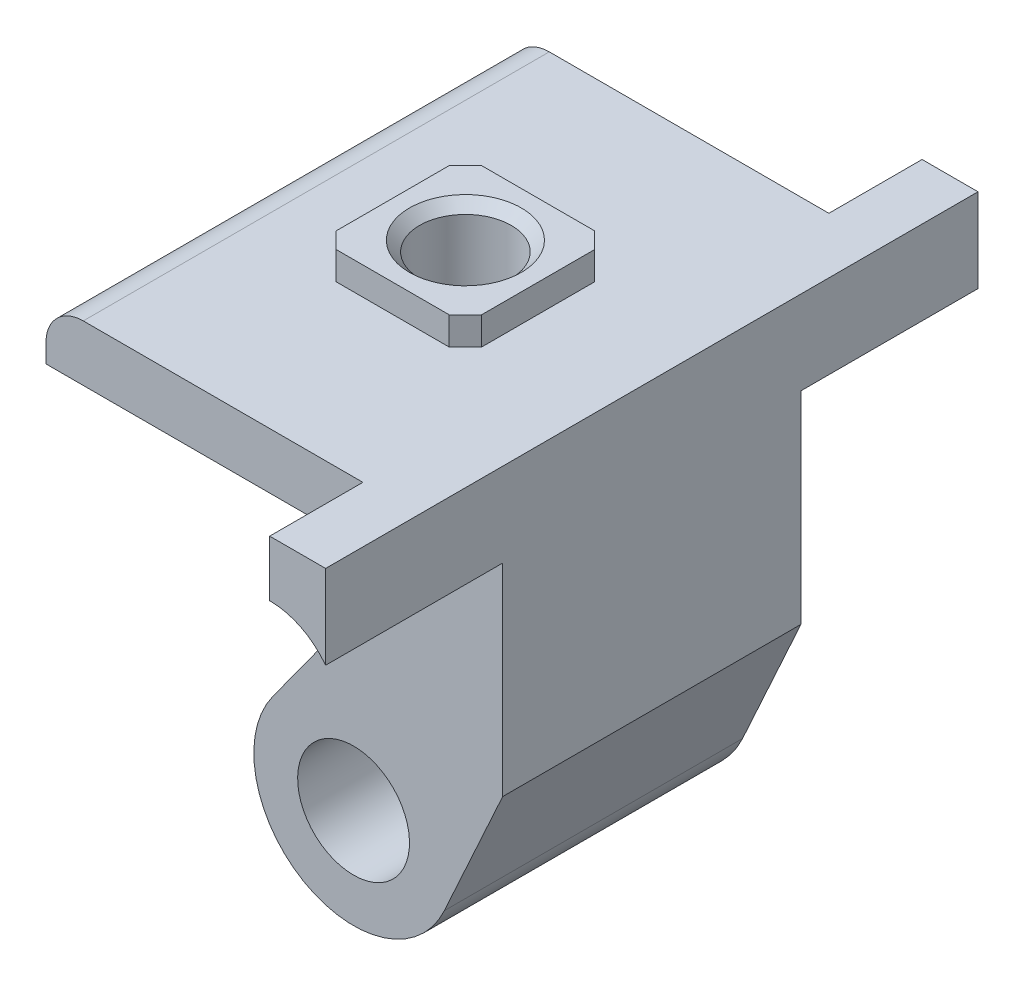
ISO-10303-21;
HEADER;
FILE_DESCRIPTION(('STEP AP214'),'2;1');
FILE_NAME('part.step','',(''),(''),'','','');
FILE_SCHEMA(('AUTOMOTIVE_DESIGN { 1 0 10303 214 1 1 1 1 }'));
ENDSEC;
DATA;
#1=APPLICATION_CONTEXT('core data for automotive mechanical design processes');
#2=APPLICATION_PROTOCOL_DEFINITION('international standard','automotive_design',2000,#1);
#3=PRODUCT_CONTEXT('',#1,'mechanical');
#4=PRODUCT('Part','Part','',(#3));
#5=PRODUCT_RELATED_PRODUCT_CATEGORY('part','',(#4));
#6=PRODUCT_DEFINITION_FORMATION('','',#4);
#7=PRODUCT_DEFINITION_CONTEXT('part definition',#1,'design');
#8=PRODUCT_DEFINITION('design','',#6,#7);
#9=PRODUCT_DEFINITION_SHAPE('','',#8);
#10=(LENGTH_UNIT() NAMED_UNIT(*) SI_UNIT(.MILLI.,.METRE.));
#11=(NAMED_UNIT(*) PLANE_ANGLE_UNIT() SI_UNIT($,.RADIAN.));
#12=(NAMED_UNIT(*) SI_UNIT($,.STERADIAN.) SOLID_ANGLE_UNIT());
#13=UNCERTAINTY_MEASURE_WITH_UNIT(LENGTH_MEASURE(1.E-05),#10,'distance_accuracy_value','');
#14=(GEOMETRIC_REPRESENTATION_CONTEXT(3) GLOBAL_UNCERTAINTY_ASSIGNED_CONTEXT((#13)) GLOBAL_UNIT_ASSIGNED_CONTEXT((#10,
#11,#12)) REPRESENTATION_CONTEXT('',''));
#15=CARTESIAN_POINT('',(0.,0.,0.));
#16=DIRECTION('',(0.,0.,1.));
#17=DIRECTION('',(1.,0.,0.));
#18=AXIS2_PLACEMENT_3D('',#15,#16,#17);
#19=CARTESIAN_POINT('',(1.5,-6.,0.));
#20=DIRECTION('',(0.,-1.,0.));
#21=DIRECTION('',(0.,0.,-1.));
#22=AXIS2_PLACEMENT_3D('',#19,#20,#21);
#23=PLANE('',#22);
#24=CARTESIAN_POINT('',(0.,-6.00000000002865,0.));
#25=DIRECTION('',(0.,-1.,0.));
#26=DIRECTION('',(0.,0.,-1.));
#27=AXIS2_PLACEMENT_3D('',#24,#25,#26);
#28=CIRCLE('',#27,3.00000000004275);
#29=CARTESIAN_POINT('',(2.02711197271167,-6.00000000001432,2.21151917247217));
#30=VERTEX_POINT('',#29);
#31=CARTESIAN_POINT('',(2.02711197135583,-6.00000000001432,-2.21151917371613));
#32=VERTEX_POINT('',#31);
#33=EDGE_CURVE('E19',#30,#32,#28,.F.);
#34=ORIENTED_EDGE('',*,*,#33,.T.);
#35=DIRECTION('',(0.,0.,1.));
#36=VECTOR('',#35,1.);
#37=CARTESIAN_POINT('',(2.02711197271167,-6.,-8.));
#38=LINE('',#37,#36);
#39=EDGE_CURVE('E137',#32,#30,#38,.T.);
#40=ORIENTED_EDGE('',*,*,#39,.T.);
#41=EDGE_LOOP('',(#34,#40));
#42=FACE_BOUND('',#41,.T.);
#43=ADVANCED_FACE('F16',(#42),#23,.F.);
#44=CARTESIAN_POINT('',(0.,-3.,0.));
#45=DIRECTION('',(0.,1.,0.));
#46=DIRECTION('',(0.,0.,1.));
#47=AXIS2_PLACEMENT_3D('',#44,#45,#46);
#48=CYLINDRICAL_SURFACE('',#47,2.459);
#49=CARTESIAN_POINT('',(0.,-5.45899999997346,0.));
#50=DIRECTION('',(0.,-1.,0.));
#51=DIRECTION('',(-1.,0.,0.));
#52=AXIS2_PLACEMENT_3D('',#49,#50,#51);
#53=CIRCLE('',#52,2.45899999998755);
#54=CARTESIAN_POINT('',(-2.45899999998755,-5.45899999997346,0.));
#55=VERTEX_POINT('',#54);
#56=EDGE_CURVE('E142',#55,#55,#53,.T.);
#57=ORIENTED_EDGE('',*,*,#56,.T.);
#58=EDGE_LOOP('',(#57));
#59=FACE_BOUND('',#58,.T.);
#60=CARTESIAN_POINT('',(0.,-0.540999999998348,0.));
#61=DIRECTION('',(0.,1.,0.));
#62=DIRECTION('',(-1.,0.,0.));
#63=AXIS2_PLACEMENT_3D('',#60,#61,#62);
#64=CIRCLE('',#63,2.45899999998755);
#65=CARTESIAN_POINT('',(-2.45899999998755,-0.540999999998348,0.));
#66=VERTEX_POINT('',#65);
#67=EDGE_CURVE('E150',#66,#66,#64,.T.);
#68=ORIENTED_EDGE('',*,*,#67,.T.);
#69=EDGE_LOOP('',(#68));
#70=FACE_BOUND('',#69,.T.);
#71=ADVANCED_FACE('F732',(#59,#70),#48,.F.);
#72=CARTESIAN_POINT('',(0.,-6.00000000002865,0.));
#73=DIRECTION('',(0.,-1.,0.));
#74=DIRECTION('',(0.,0.,-1.));
#75=AXIS2_PLACEMENT_3D('',#72,#73,#74);
#76=CONICAL_SURFACE('',#75,3.00000000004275,0.785398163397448);
#77=ORIENTED_EDGE('',*,*,#56,.F.);
#78=EDGE_LOOP('',(#77));
#79=FACE_BOUND('',#78,.T.);
#80=CARTESIAN_POINT('',(0.,-6.00000000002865,0.));
#81=DIRECTION('',(0.,-1.,0.));
#82=DIRECTION('',(0.,0.,-1.));
#83=AXIS2_PLACEMENT_3D('',#80,#81,#82);
#84=CIRCLE('',#83,3.00000000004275);
#85=EDGE_CURVE('E144',#32,#30,#84,.F.);
#86=ORIENTED_EDGE('',*,*,#85,.F.);
#87=ORIENTED_EDGE('',*,*,#33,.F.);
#88=EDGE_LOOP('',(#86,#87));
#89=FACE_BOUND('',#88,.T.);
#90=ADVANCED_FACE('F145',(#79,#89),#76,.F.);
#91=CARTESIAN_POINT('',(2.02711197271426,-6.99999999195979,-8.));
#92=DIRECTION('',(0.,0.,1.));
#93=DIRECTION('',(1.,0.,0.));
#94=AXIS2_PLACEMENT_3D('',#91,#92,#93);
#95=CYLINDRICAL_SURFACE('',#94,0.99999999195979);
#96=DIRECTION('',(0.,0.,-1.));
#97=VECTOR('',#96,1.);
#98=CARTESIAN_POINT('',(2.02711197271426,-6.,-8.));
#99=LINE('',#98,#97);
#100=CARTESIAN_POINT('',(2.02711197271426,-6.,8.));
#101=VERTEX_POINT('',#100);
#102=EDGE_CURVE('E149',#30,#101,#99,.F.);
#103=ORIENTED_EDGE('',*,*,#102,.F.);
#104=ORIENTED_EDGE('',*,*,#39,.F.);
#105=DIRECTION('',(0.,0.,-1.));
#106=VECTOR('',#105,1.);
#107=CARTESIAN_POINT('',(2.02711197,-6.,-8.));
#108=LINE('',#107,#106);
#109=CARTESIAN_POINT('',(2.02711197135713,-6.,-8.));
#110=VERTEX_POINT('',#109);
#111=EDGE_CURVE('E155',#110,#32,#108,.F.);
#112=ORIENTED_EDGE('',*,*,#111,.F.);
#113=CARTESIAN_POINT('',(2.02711197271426,-6.99999999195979,-8.));
#114=DIRECTION('',(0.,0.,1.));
#115=DIRECTION('',(1.,0.,0.));
#116=AXIS2_PLACEMENT_3D('',#113,#114,#115);
#117=CIRCLE('',#116,0.99999999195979);
#118=CARTESIAN_POINT('',(2.99128057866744,-6.73470980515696,-8.));
#119=VERTEX_POINT('',#118);
#120=EDGE_CURVE('E158',#119,#110,#117,.T.);
#121=ORIENTED_EDGE('',*,*,#120,.F.);
#122=DIRECTION('',(0.,0.,1.));
#123=VECTOR('',#122,1.);
#124=CARTESIAN_POINT('',(2.99128058,-6.73470981,-8.));
#125=LINE('',#124,#123);
#126=CARTESIAN_POINT('',(2.99128057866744,-6.73470980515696,8.));
#127=VERTEX_POINT('',#126);
#128=EDGE_CURVE('E164',#127,#119,#125,.F.);
#129=ORIENTED_EDGE('',*,*,#128,.F.);
#130=CARTESIAN_POINT('',(2.02711197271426,-6.99999999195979,8.));
#131=DIRECTION('',(0.,0.,1.));
#132=DIRECTION('',(1.,0.,0.));
#133=AXIS2_PLACEMENT_3D('',#130,#131,#132);
#134=CIRCLE('',#133,0.99999999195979);
#135=EDGE_CURVE('E157',#101,#127,#134,.F.);
#136=ORIENTED_EDGE('',*,*,#135,.F.);
#137=EDGE_LOOP('',(#103,#104,#112,#121,#129,#136));
#138=FACE_BOUND('',#137,.T.);
#139=ADVANCED_FACE('F154',(#138),#95,.F.);
#140=CARTESIAN_POINT('',(1.66134159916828,-9.44010398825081,-8.));
#141=DIRECTION('',(0.,0.,1.));
#142=DIRECTION('',(1.,0.,0.));
#143=AXIS2_PLACEMENT_3D('',#140,#141,#142);
#144=CYLINDRICAL_SURFACE('',#143,1.99999996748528);
#145=CARTESIAN_POINT('',(1.66134159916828,-9.44010398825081,-8.));
#146=DIRECTION('',(0.,0.,1.));
#147=DIRECTION('',(1.,0.,0.));
#148=AXIS2_PLACEMENT_3D('',#145,#146,#147);
#149=CIRCLE('',#148,1.99999996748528);
#150=CARTESIAN_POINT('',(3.28092430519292,-10.6135398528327,-8.));
#151=VERTEX_POINT('',#150);
#152=CARTESIAN_POINT('',(3.58967879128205,-8.90952360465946,-8.));
#153=VERTEX_POINT('',#152);
#154=EDGE_CURVE('E184',#151,#153,#149,.T.);
#155=ORIENTED_EDGE('',*,*,#154,.F.);
#156=DIRECTION('',(0.,0.,1.));
#157=VECTOR('',#156,1.);
#158=CARTESIAN_POINT('',(3.2809243,-10.61353986,-8.));
#159=LINE('',#158,#157);
#160=CARTESIAN_POINT('',(3.28092430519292,-10.6135398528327,8.));
#161=VERTEX_POINT('',#160);
#162=EDGE_CURVE('E295',#161,#151,#159,.F.);
#163=ORIENTED_EDGE('',*,*,#162,.F.);
#164=CARTESIAN_POINT('',(1.66134159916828,-9.44010398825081,8.));
#165=DIRECTION('',(0.,0.,1.));
#166=DIRECTION('',(1.,0.,0.));
#167=AXIS2_PLACEMENT_3D('',#164,#165,#166);
#168=CIRCLE('',#167,1.99999996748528);
#169=CARTESIAN_POINT('',(3.58967879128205,-8.90952360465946,8.));
#170=VERTEX_POINT('',#169);
#171=EDGE_CURVE('E239',#170,#161,#168,.F.);
#172=ORIENTED_EDGE('',*,*,#171,.F.);
#173=DIRECTION('',(0.,0.,1.));
#174=VECTOR('',#173,1.);
#175=CARTESIAN_POINT('',(3.58967879,-8.9095236,-8.));
#176=LINE('',#175,#174);
#177=EDGE_CURVE('E168',#153,#170,#176,.T.);
#178=ORIENTED_EDGE('',*,*,#177,.F.);
#179=EDGE_LOOP('',(#155,#163,#172,#178));
#180=FACE_BOUND('',#179,.T.);
#181=ADVANCED_FACE('F726',(#180),#144,.F.);
#182=CARTESIAN_POINT('',(-5.,-5.5,-8.));
#183=DIRECTION('',(-1.,0.,0.));
#184=DIRECTION('',(0.,-1.,0.));
#185=AXIS2_PLACEMENT_3D('',#182,#183,#184);
#186=PLANE('',#185);
#187=DIRECTION('',(0.,-1.,0.));
#188=VECTOR('',#187,1.);
#189=CARTESIAN_POINT('',(-5.,-5.5,-8.));
#190=LINE('',#189,#188);
#191=CARTESIAN_POINT('',(-5.,-5.,-8.));
#192=VERTEX_POINT('',#191);
#193=CARTESIAN_POINT('',(-5.,-6.,-8.));
#194=VERTEX_POINT('',#193);
#195=EDGE_CURVE('E183',#192,#194,#190,.T.);
#196=ORIENTED_EDGE('',*,*,#195,.T.);
#197=DIRECTION('',(0.,0.,-1.));
#198=VECTOR('',#197,1.);
#199=CARTESIAN_POINT('',(-5.,-6.,-8.));
#200=LINE('',#199,#198);
#201=CARTESIAN_POINT('',(-5.,-6.,8.));
#202=VERTEX_POINT('',#201);
#203=EDGE_CURVE('E165',#202,#194,#200,.T.);
#204=ORIENTED_EDGE('',*,*,#203,.F.);
#205=DIRECTION('',(0.,-1.,0.));
#206=VECTOR('',#205,1.);
#207=CARTESIAN_POINT('',(-5.,-5.5,8.));
#208=LINE('',#207,#206);
#209=CARTESIAN_POINT('',(-5.,-5.,8.));
#210=VERTEX_POINT('',#209);
#211=EDGE_CURVE('E181',#202,#210,#208,.F.);
#212=ORIENTED_EDGE('',*,*,#211,.T.);
#213=DIRECTION('',(0.,0.,1.));
#214=VECTOR('',#213,1.);
#215=CARTESIAN_POINT('',(-5.,-5.,-8.));
#216=LINE('',#215,#214);
#217=EDGE_CURVE('E176',#210,#192,#216,.F.);
#218=ORIENTED_EDGE('',*,*,#217,.T.);
#219=EDGE_LOOP('',(#196,#204,#212,#218));
#220=FACE_BOUND('',#219,.T.);
#221=ADVANCED_FACE('F539',(#220),#186,.T.);
#222=CARTESIAN_POINT('',(0.,-5.6843418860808E-11,0.));
#223=DIRECTION('',(0.,1.,0.));
#224=DIRECTION('',(0.,0.,1.));
#225=AXIS2_PLACEMENT_3D('',#222,#223,#224);
#226=CONICAL_SURFACE('',#225,2.99999999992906,0.785398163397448);
#227=ORIENTED_EDGE('',*,*,#67,.F.);
#228=EDGE_LOOP('',(#227));
#229=FACE_BOUND('',#228,.T.);
#230=CARTESIAN_POINT('',(0.,0.,0.));
#231=DIRECTION('',(0.,1.,0.));
#232=DIRECTION('',(0.,0.,1.));
#233=AXIS2_PLACEMENT_3D('',#230,#231,#232);
#234=CIRCLE('',#233,2.9999999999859);
#235=CARTESIAN_POINT('',(0.,0.,2.9999999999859));
#236=VERTEX_POINT('',#235);
#237=EDGE_CURVE('E179',#236,#236,#234,.F.);
#238=ORIENTED_EDGE('',*,*,#237,.F.);
#239=EDGE_LOOP('',(#238));
#240=FACE_BOUND('',#239,.T.);
#241=ADVANCED_FACE('F719',(#229,#240),#226,.F.);
#242=CARTESIAN_POINT('',(2.,-21.5,0.));
#243=DIRECTION('',(0.,0.,1.));
#244=DIRECTION('',(0.,-1.,0.));
#245=AXIS2_PLACEMENT_3D('',#242,#243,#244);
#246=CYLINDRICAL_SURFACE('',#245,3.);
#247=CARTESIAN_POINT('',(2.,-21.5,8.));
#248=DIRECTION('',(0.,0.,1.));
#249=DIRECTION('',(0.,-1.,0.));
#250=AXIS2_PLACEMENT_3D('',#247,#248,#249);
#251=CIRCLE('',#250,3.);
#252=CARTESIAN_POINT('',(2.,-24.5,8.));
#253=VERTEX_POINT('',#252);
#254=EDGE_CURVE('E233',#253,#253,#251,.F.);
#255=ORIENTED_EDGE('',*,*,#254,.F.);
#256=EDGE_LOOP('',(#255));
#257=FACE_BOUND('',#256,.T.);
#258=CARTESIAN_POINT('',(2.,-21.5,-8.));
#259=DIRECTION('',(0.,0.,1.));
#260=DIRECTION('',(0.,-1.,0.));
#261=AXIS2_PLACEMENT_3D('',#258,#259,#260);
#262=CIRCLE('',#261,3.);
#263=CARTESIAN_POINT('',(2.,-24.5,-8.));
#264=VERTEX_POINT('',#263);
#265=EDGE_CURVE('E221',#264,#264,#262,.F.);
#266=ORIENTED_EDGE('',*,*,#265,.T.);
#267=EDGE_LOOP('',(#266));
#268=FACE_BOUND('',#267,.T.);
#269=ADVANCED_FACE('F716',(#257,#268),#246,.F.);
#270=CARTESIAN_POINT('',(-1.486444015,-6.,-8.));
#271=DIRECTION('',(0.,-1.,0.));
#272=DIRECTION('',(0.,0.,-1.));
#273=AXIS2_PLACEMENT_3D('',#270,#271,#272);
#274=PLANE('',#273);
#275=DIRECTION('',(1.,0.,0.));
#276=VECTOR('',#275,1.);
#277=CARTESIAN_POINT('',(2.94821898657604,-6.,-8.));
#278=LINE('',#277,#276);
#279=EDGE_CURVE('E163',#194,#110,#278,.T.);
#280=ORIENTED_EDGE('',*,*,#279,.T.);
#281=ORIENTED_EDGE('',*,*,#111,.T.);
#282=ORIENTED_EDGE('',*,*,#85,.T.);
#283=ORIENTED_EDGE('',*,*,#102,.T.);
#284=DIRECTION('',(1.,0.,0.));
#285=VECTOR('',#284,1.);
#286=CARTESIAN_POINT('',(2.94821898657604,-6.,8.));
#287=LINE('',#286,#285);
#288=EDGE_CURVE('E232',#202,#101,#287,.T.);
#289=ORIENTED_EDGE('',*,*,#288,.F.);
#290=ORIENTED_EDGE('',*,*,#203,.T.);
#291=EDGE_LOOP('',(#280,#281,#282,#283,#289,#290));
#292=FACE_BOUND('',#291,.T.);
#293=ADVANCED_FACE('F160',(#292),#274,.T.);
#294=CARTESIAN_POINT('',(3.290479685,-7.822116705,-8.));
#295=DIRECTION('',(-0.964168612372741,-0.265290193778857,0.));
#296=DIRECTION('',(0.265290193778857,-0.964168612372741,0.));
#297=AXIS2_PLACEMENT_3D('',#294,#295,#296);
#298=PLANE('',#297);
#299=DIRECTION('',(0.265290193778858,-0.964168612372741,0.));
#300=VECTOR('',#299,1.);
#301=CARTESIAN_POINT('',(2.99128058,-6.73470981,-8.));
#302=LINE('',#301,#300);
#303=EDGE_CURVE('E246',#119,#153,#302,.T.);
#304=ORIENTED_EDGE('',*,*,#303,.T.);
#305=ORIENTED_EDGE('',*,*,#177,.T.);
#306=DIRECTION('',(0.265290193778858,-0.964168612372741,0.));
#307=VECTOR('',#306,1.);
#308=CARTESIAN_POINT('',(2.99128058,-6.73470981,8.));
#309=LINE('',#308,#307);
#310=EDGE_CURVE('E253',#127,#170,#309,.T.);
#311=ORIENTED_EDGE('',*,*,#310,.F.);
#312=ORIENTED_EDGE('',*,*,#128,.T.);
#313=EDGE_LOOP('',(#304,#305,#311,#312));
#314=FACE_BOUND('',#313,.T.);
#315=ADVANCED_FACE('F250',(#314),#298,.T.);
#316=CARTESIAN_POINT('',(0.474270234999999,-14.487299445,-8.));
#317=DIRECTION('',(-0.809791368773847,0.586717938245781,0.));
#318=DIRECTION('',(-0.586717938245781,-0.809791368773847,0.));
#319=AXIS2_PLACEMENT_3D('',#316,#317,#318);
#320=PLANE('',#319);
#321=DIRECTION('',(-0.586717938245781,-0.809791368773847,0.));
#322=VECTOR('',#321,1.);
#323=CARTESIAN_POINT('',(3.2809243,-10.61353986,-8.));
#324=LINE('',#323,#322);
#325=CARTESIAN_POINT('',(-2.33238382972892,-18.3610590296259,-8.));
#326=VERTEX_POINT('',#325);
#327=EDGE_CURVE('E217',#151,#326,#324,.T.);
#328=ORIENTED_EDGE('',*,*,#327,.T.);
#329=DIRECTION('',(0.,0.,1.));
#330=VECTOR('',#329,1.);
#331=CARTESIAN_POINT('',(-2.33238382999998,-18.36105903,-8.));
#332=LINE('',#331,#330);
#333=CARTESIAN_POINT('',(-2.33238382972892,-18.3610590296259,8.));
#334=VERTEX_POINT('',#333);
#335=EDGE_CURVE('E180',#334,#326,#332,.F.);
#336=ORIENTED_EDGE('',*,*,#335,.F.);
#337=DIRECTION('',(-0.586717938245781,-0.809791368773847,0.));
#338=VECTOR('',#337,1.);
#339=CARTESIAN_POINT('',(3.2809243,-10.61353986,8.));
#340=LINE('',#339,#338);
#341=EDGE_CURVE('E228',#161,#334,#340,.T.);
#342=ORIENTED_EDGE('',*,*,#341,.F.);
#343=ORIENTED_EDGE('',*,*,#162,.T.);
#344=EDGE_LOOP('',(#328,#336,#342,#343));
#345=FACE_BOUND('',#344,.T.);
#346=ADVANCED_FACE('F302',(#345),#320,.T.);
#347=CARTESIAN_POINT('',(1.9999999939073,-21.4999999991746,-8.));
#348=DIRECTION('',(0.,0.,1.));
#349=DIRECTION('',(1.,0.,0.));
#350=AXIS2_PLACEMENT_3D('',#347,#348,#349);
#351=CYLINDRICAL_SURFACE('',#350,5.35000000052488);
#352=DIRECTION('',(0.,0.,1.));
#353=VECTOR('',#352,1.);
#354=CARTESIAN_POINT('',(6.86781516,-23.71965662,-8.));
#355=LINE('',#354,#353);
#356=CARTESIAN_POINT('',(6.86781515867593,-23.7196566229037,8.));
#357=VERTEX_POINT('',#356);
#358=CARTESIAN_POINT('',(6.86781515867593,-23.7196566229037,-8.));
#359=VERTEX_POINT('',#358);
#360=EDGE_CURVE('E224',#357,#359,#355,.F.);
#361=ORIENTED_EDGE('',*,*,#360,.F.);
#362=CARTESIAN_POINT('',(1.9999999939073,-21.4999999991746,8.));
#363=DIRECTION('',(0.,0.,1.));
#364=DIRECTION('',(1.,0.,0.));
#365=AXIS2_PLACEMENT_3D('',#362,#363,#364);
#366=CIRCLE('',#365,5.35000000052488);
#367=EDGE_CURVE('E225',#334,#357,#366,.T.);
#368=ORIENTED_EDGE('',*,*,#367,.F.);
#369=ORIENTED_EDGE('',*,*,#335,.T.);
#370=CARTESIAN_POINT('',(1.9999999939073,-21.4999999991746,-8.));
#371=DIRECTION('',(0.,0.,1.));
#372=DIRECTION('',(1.,0.,0.));
#373=AXIS2_PLACEMENT_3D('',#370,#371,#372);
#374=CIRCLE('',#373,5.35000000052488);
#375=EDGE_CURVE('E215',#326,#359,#374,.T.);
#376=ORIENTED_EDGE('',*,*,#375,.T.);
#377=EDGE_LOOP('',(#361,#368,#369,#376));
#378=FACE_BOUND('',#377,.T.);
#379=ADVANCED_FACE('F706',(#378),#351,.T.);
#380=CARTESIAN_POINT('',(-5.5,-5.,-8.));
#381=DIRECTION('',(0.,0.,1.));
#382=DIRECTION('',(1.,0.,0.));
#383=AXIS2_PLACEMENT_3D('',#380,#381,#382);
#384=CYLINDRICAL_SURFACE('',#383,0.5);
#385=DIRECTION('',(0.,0.,-1.));
#386=VECTOR('',#385,1.);
#387=CARTESIAN_POINT('',(-5.5,-4.5,-12.5));
#388=LINE('',#387,#386);
#389=CARTESIAN_POINT('',(-5.5,-4.5,-8.));
#390=VERTEX_POINT('',#389);
#391=CARTESIAN_POINT('',(-5.5,-4.5,8.));
#392=VERTEX_POINT('',#391);
#393=EDGE_CURVE('E285',#390,#392,#388,.F.);
#394=ORIENTED_EDGE('',*,*,#393,.F.);
#395=CARTESIAN_POINT('',(-5.5,-5.,-8.));
#396=DIRECTION('',(0.,0.,1.));
#397=DIRECTION('',(1.,0.,0.));
#398=AXIS2_PLACEMENT_3D('',#395,#396,#397);
#399=CIRCLE('',#398,0.5);
#400=EDGE_CURVE('E218',#390,#192,#399,.F.);
#401=ORIENTED_EDGE('',*,*,#400,.T.);
#402=ORIENTED_EDGE('',*,*,#217,.F.);
#403=CARTESIAN_POINT('',(-5.5,-5.,8.));
#404=DIRECTION('',(0.,0.,1.));
#405=DIRECTION('',(1.,0.,0.));
#406=AXIS2_PLACEMENT_3D('',#403,#404,#405);
#407=CIRCLE('',#406,0.5);
#408=EDGE_CURVE('E229',#392,#210,#407,.F.);
#409=ORIENTED_EDGE('',*,*,#408,.F.);
#410=EDGE_LOOP('',(#394,#401,#402,#409));
#411=FACE_BOUND('',#410,.T.);
#412=ADVANCED_FACE('F548',(#411),#384,.F.);
#413=CARTESIAN_POINT('',(0.,0.,0.));
#414=DIRECTION('',(0.,1.,0.));
#415=DIRECTION('',(0.,0.,1.));
#416=AXIS2_PLACEMENT_3D('',#413,#414,#415);
#417=PLANE('',#416);
#418=DIRECTION('',(-0.707106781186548,0.,-0.707106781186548));
#419=VECTOR('',#418,1.);
#420=CARTESIAN_POINT('',(3.46482323,0.,-3.46482323));
#421=LINE('',#420,#419);
#422=CARTESIAN_POINT('',(3.02964646,0.,-3.9));
#423=VERTEX_POINT('',#422);
#424=CARTESIAN_POINT('',(3.9,0.,-3.02964646));
#425=VERTEX_POINT('',#424);
#426=EDGE_CURVE('E396',#423,#425,#421,.F.);
#427=ORIENTED_EDGE('',*,*,#426,.F.);
#428=DIRECTION('',(1.,0.,0.));
#429=VECTOR('',#428,1.);
#430=CARTESIAN_POINT('',(0.,0.,-3.9));
#431=LINE('',#430,#429);
#432=CARTESIAN_POINT('',(-3.02964646,0.,-3.9));
#433=VERTEX_POINT('',#432);
#434=EDGE_CURVE('E402',#433,#423,#431,.T.);
#435=ORIENTED_EDGE('',*,*,#434,.F.);
#436=DIRECTION('',(-0.707106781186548,0.,0.707106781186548));
#437=VECTOR('',#436,1.);
#438=CARTESIAN_POINT('',(-3.46482323,0.,-3.46482323));
#439=LINE('',#438,#437);
#440=CARTESIAN_POINT('',(-3.9,0.,-3.02964646));
#441=VERTEX_POINT('',#440);
#442=EDGE_CURVE('E405',#441,#433,#439,.F.);
#443=ORIENTED_EDGE('',*,*,#442,.F.);
#444=DIRECTION('',(0.,0.,1.));
#445=VECTOR('',#444,1.);
#446=CARTESIAN_POINT('',(-3.9,0.,0.));
#447=LINE('',#446,#445);
#448=CARTESIAN_POINT('',(-3.9,0.,3.02964646));
#449=VERTEX_POINT('',#448);
#450=EDGE_CURVE('E366',#449,#441,#447,.F.);
#451=ORIENTED_EDGE('',*,*,#450,.F.);
#452=DIRECTION('',(0.707106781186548,0.,0.707106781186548));
#453=VECTOR('',#452,1.);
#454=CARTESIAN_POINT('',(-3.46482323,0.,3.46482323));
#455=LINE('',#454,#453);
#456=CARTESIAN_POINT('',(-3.02964646,0.,3.9));
#457=VERTEX_POINT('',#456);
#458=EDGE_CURVE('E372',#457,#449,#455,.F.);
#459=ORIENTED_EDGE('',*,*,#458,.F.);
#460=DIRECTION('',(1.,0.,0.));
#461=VECTOR('',#460,1.);
#462=CARTESIAN_POINT('',(0.,0.,3.9));
#463=LINE('',#462,#461);
#464=CARTESIAN_POINT('',(3.02964646,0.,3.9));
#465=VERTEX_POINT('',#464);
#466=EDGE_CURVE('E378',#465,#457,#463,.F.);
#467=ORIENTED_EDGE('',*,*,#466,.F.);
#468=DIRECTION('',(0.707106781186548,0.,-0.707106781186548));
#469=VECTOR('',#468,1.);
#470=CARTESIAN_POINT('',(3.46482323,0.,3.46482323));
#471=LINE('',#470,#469);
#472=CARTESIAN_POINT('',(3.9,0.,3.02964646));
#473=VERTEX_POINT('',#472);
#474=EDGE_CURVE('E384',#473,#465,#471,.F.);
#475=ORIENTED_EDGE('',*,*,#474,.F.);
#476=DIRECTION('',(0.,0.,-1.));
#477=VECTOR('',#476,1.);
#478=CARTESIAN_POINT('',(3.9,0.,0.));
#479=LINE('',#478,#477);
#480=EDGE_CURVE('E390',#425,#473,#479,.F.);
#481=ORIENTED_EDGE('',*,*,#480,.F.);
#482=EDGE_LOOP('',(#427,#435,#443,#451,#459,#467,#475,#481));
#483=FACE_BOUND('',#482,.T.);
#484=ORIENTED_EDGE('',*,*,#237,.T.);
#485=EDGE_LOOP('',(#484));
#486=FACE_BOUND('',#485,.T.);
#487=ADVANCED_FACE('F700',(#483,#486),#417,.T.);
#488=CARTESIAN_POINT('',(2.94821898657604,-13.3196516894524,8.));
#489=DIRECTION('',(0.,0.,1.));
#490=DIRECTION('',(1.,0.,0.));
#491=AXIS2_PLACEMENT_3D('',#488,#489,#490);
#492=PLANE('',#491);
#493=ORIENTED_EDGE('',*,*,#341,.T.);
#494=ORIENTED_EDGE('',*,*,#367,.T.);
#495=DIRECTION('',(0.414889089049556,0.909871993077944,0.));
#496=VECTOR('',#495,1.);
#497=CARTESIAN_POINT('',(8.43390758,-20.285139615,8.));
#498=LINE('',#497,#496);
#499=CARTESIAN_POINT('',(10.,-16.85062261,8.));
#500=VERTEX_POINT('',#499);
#501=EDGE_CURVE('E227',#500,#357,#498,.F.);
#502=ORIENTED_EDGE('',*,*,#501,.F.);
#503=DIRECTION('',(0.,1.,0.));
#504=VECTOR('',#503,1.);
#505=CARTESIAN_POINT('',(10.,-11.425311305,8.));
#506=LINE('',#505,#504);
#507=CARTESIAN_POINT('',(10.,-6.,8.));
#508=VERTEX_POINT('',#507);
#509=EDGE_CURVE('E318',#508,#500,#506,.F.);
#510=ORIENTED_EDGE('',*,*,#509,.F.);
#511=CARTESIAN_POINT('',(6.99999999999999,-8.25000000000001,8.));
#512=DIRECTION('',(0.,0.,1.));
#513=DIRECTION('',(1.,0.,0.));
#514=AXIS2_PLACEMENT_3D('',#511,#512,#513);
#515=CIRCLE('',#514,3.75000000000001);
#516=CARTESIAN_POINT('',(7.,-4.5,8.));
#517=VERTEX_POINT('',#516);
#518=EDGE_CURVE('E212',#508,#517,#515,.T.);
#519=ORIENTED_EDGE('',*,*,#518,.T.);
#520=DIRECTION('',(1.,0.,0.));
#521=VECTOR('',#520,1.);
#522=CARTESIAN_POINT('',(-1.5,-4.5,8.));
#523=LINE('',#522,#521);
#524=EDGE_CURVE('E211',#392,#517,#523,.T.);
#525=ORIENTED_EDGE('',*,*,#524,.F.);
#526=ORIENTED_EDGE('',*,*,#408,.T.);
#527=ORIENTED_EDGE('',*,*,#211,.F.);
#528=ORIENTED_EDGE('',*,*,#288,.T.);
#529=ORIENTED_EDGE('',*,*,#135,.T.);
#530=ORIENTED_EDGE('',*,*,#310,.T.);
#531=ORIENTED_EDGE('',*,*,#171,.T.);
#532=EDGE_LOOP('',(#493,#494,#502,#510,#519,#525,#526,#527,#528,#529,#530,#531));
#533=FACE_BOUND('',#532,.T.);
#534=ORIENTED_EDGE('',*,*,#254,.T.);
#535=EDGE_LOOP('',(#534));
#536=FACE_BOUND('',#535,.T.);
#537=ADVANCED_FACE('F543',(#533,#536),#492,.T.);
#538=CARTESIAN_POINT('',(8.43390758,-20.285139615,-8.));
#539=DIRECTION('',(0.909871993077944,-0.414889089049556,0.));
#540=DIRECTION('',(0.414889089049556,0.909871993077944,0.));
#541=AXIS2_PLACEMENT_3D('',#538,#539,#540);
#542=PLANE('',#541);
#543=DIRECTION('',(0.414889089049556,0.909871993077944,0.));
#544=VECTOR('',#543,1.);
#545=CARTESIAN_POINT('',(6.86781516,-23.71965662,-8.));
#546=LINE('',#545,#544);
#547=CARTESIAN_POINT('',(10.,-16.85062261,-8.));
#548=VERTEX_POINT('',#547);
#549=EDGE_CURVE('E214',#359,#548,#546,.T.);
#550=ORIENTED_EDGE('',*,*,#549,.T.);
#551=DIRECTION('',(0.,0.,-1.));
#552=VECTOR('',#551,1.);
#553=CARTESIAN_POINT('',(10.,-16.85062261,-8.));
#554=LINE('',#553,#552);
#555=EDGE_CURVE('E314',#500,#548,#554,.T.);
#556=ORIENTED_EDGE('',*,*,#555,.F.);
#557=ORIENTED_EDGE('',*,*,#501,.T.);
#558=ORIENTED_EDGE('',*,*,#360,.T.);
#559=EDGE_LOOP('',(#550,#556,#557,#558));
#560=FACE_BOUND('',#559,.T.);
#561=ADVANCED_FACE('F443',(#560),#542,.T.);
#562=CARTESIAN_POINT('',(2.94821898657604,-13.3196516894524,-8.));
#563=DIRECTION('',(0.,0.,1.));
#564=DIRECTION('',(1.,0.,0.));
#565=AXIS2_PLACEMENT_3D('',#562,#563,#564);
#566=PLANE('',#565);
#567=ORIENTED_EDGE('',*,*,#375,.F.);
#568=ORIENTED_EDGE('',*,*,#327,.F.);
#569=ORIENTED_EDGE('',*,*,#154,.T.);
#570=ORIENTED_EDGE('',*,*,#303,.F.);
#571=ORIENTED_EDGE('',*,*,#120,.T.);
#572=ORIENTED_EDGE('',*,*,#279,.F.);
#573=ORIENTED_EDGE('',*,*,#195,.F.);
#574=ORIENTED_EDGE('',*,*,#400,.F.);
#575=DIRECTION('',(1.,0.,0.));
#576=VECTOR('',#575,1.);
#577=CARTESIAN_POINT('',(-1.5,-4.5,-8.));
#578=LINE('',#577,#576);
#579=CARTESIAN_POINT('',(7.,-4.5,-8.));
#580=VERTEX_POINT('',#579);
#581=EDGE_CURVE('E282',#580,#390,#578,.F.);
#582=ORIENTED_EDGE('',*,*,#581,.F.);
#583=CARTESIAN_POINT('',(6.99999999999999,-8.25000000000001,-8.));
#584=DIRECTION('',(0.,0.,1.));
#585=DIRECTION('',(1.,0.,0.));
#586=AXIS2_PLACEMENT_3D('',#583,#584,#585);
#587=CIRCLE('',#586,3.75000000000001);
#588=CARTESIAN_POINT('',(10.,-6.,-8.));
#589=VERTEX_POINT('',#588);
#590=EDGE_CURVE('E209',#580,#589,#587,.F.);
#591=ORIENTED_EDGE('',*,*,#590,.T.);
#592=DIRECTION('',(0.,1.,0.));
#593=VECTOR('',#592,1.);
#594=CARTESIAN_POINT('',(10.,-11.425311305,-8.));
#595=LINE('',#594,#593);
#596=EDGE_CURVE('E317',#548,#589,#595,.T.);
#597=ORIENTED_EDGE('',*,*,#596,.F.);
#598=ORIENTED_EDGE('',*,*,#549,.F.);
#599=EDGE_LOOP('',(#567,#568,#569,#570,#571,#572,#573,#574,#582,#591,#597,#598));
#600=FACE_BOUND('',#599,.T.);
#601=ORIENTED_EDGE('',*,*,#265,.F.);
#602=EDGE_LOOP('',(#601));
#603=FACE_BOUND('',#602,.T.);
#604=ADVANCED_FACE('F243',(#600,#603),#566,.F.);
#605=CARTESIAN_POINT('',(6.99999999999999,-8.25000000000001,-17.5));
#606=DIRECTION('',(0.,0.,1.));
#607=DIRECTION('',(1.,0.,0.));
#608=AXIS2_PLACEMENT_3D('',#605,#606,#607);
#609=CYLINDRICAL_SURFACE('',#608,3.75000000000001);
#610=DIRECTION('',(0.,0.,-1.));
#611=VECTOR('',#610,1.);
#612=CARTESIAN_POINT('',(10.,-6.,-8.));
#613=LINE('',#612,#611);
#614=CARTESIAN_POINT('',(10.,-6.,17.5));
#615=VERTEX_POINT('',#614);
#616=EDGE_CURVE('E204',#615,#508,#613,.T.);
#617=ORIENTED_EDGE('',*,*,#616,.F.);
#618=CARTESIAN_POINT('',(6.99999999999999,-8.25000000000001,17.5));
#619=DIRECTION('',(0.,0.,1.));
#620=DIRECTION('',(1.,0.,0.));
#621=AXIS2_PLACEMENT_3D('',#618,#619,#620);
#622=CIRCLE('',#621,3.75000000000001);
#623=CARTESIAN_POINT('',(7.,-4.5,17.5));
#624=VERTEX_POINT('',#623);
#625=EDGE_CURVE('E205',#624,#615,#622,.F.);
#626=ORIENTED_EDGE('',*,*,#625,.F.);
#627=DIRECTION('',(0.,0.,1.));
#628=VECTOR('',#627,1.);
#629=CARTESIAN_POINT('',(7.,-4.5,-17.5));
#630=LINE('',#629,#628);
#631=CARTESIAN_POINT('',(7.,-4.5,12.5));
#632=VERTEX_POINT('',#631);
#633=EDGE_CURVE('E208',#632,#624,#630,.T.);
#634=ORIENTED_EDGE('',*,*,#633,.F.);
#635=DIRECTION('',(0.,0.,-1.));
#636=VECTOR('',#635,1.);
#637=CARTESIAN_POINT('',(7.,-4.5,-12.5));
#638=LINE('',#637,#636);
#639=EDGE_CURVE('E276',#517,#632,#638,.F.);
#640=ORIENTED_EDGE('',*,*,#639,.F.);
#641=ORIENTED_EDGE('',*,*,#518,.F.);
#642=EDGE_LOOP('',(#617,#626,#634,#640,#641));
#643=FACE_BOUND('',#642,.T.);
#644=ADVANCED_FACE('F690',(#643),#609,.F.);
#645=CARTESIAN_POINT('',(6.99999999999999,-8.25000000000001,-17.5));
#646=DIRECTION('',(0.,0.,1.));
#647=DIRECTION('',(1.,0.,0.));
#648=AXIS2_PLACEMENT_3D('',#645,#646,#647);
#649=CYLINDRICAL_SURFACE('',#648,3.75000000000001);
#650=DIRECTION('',(0.,0.,-1.));
#651=VECTOR('',#650,1.);
#652=CARTESIAN_POINT('',(7.,-4.5,-12.5));
#653=LINE('',#652,#651);
#654=CARTESIAN_POINT('',(7.,-4.5,-12.5));
#655=VERTEX_POINT('',#654);
#656=EDGE_CURVE('E279',#655,#580,#653,.F.);
#657=ORIENTED_EDGE('',*,*,#656,.F.);
#658=DIRECTION('',(0.,0.,1.));
#659=VECTOR('',#658,1.);
#660=CARTESIAN_POINT('',(7.,-4.5,-17.5));
#661=LINE('',#660,#659);
#662=CARTESIAN_POINT('',(7.,-4.5,-17.5));
#663=VERTEX_POINT('',#662);
#664=EDGE_CURVE('E420',#663,#655,#661,.T.);
#665=ORIENTED_EDGE('',*,*,#664,.F.);
#666=CARTESIAN_POINT('',(6.99999999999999,-8.25000000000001,-17.5));
#667=DIRECTION('',(0.,0.,1.));
#668=DIRECTION('',(1.,0.,0.));
#669=AXIS2_PLACEMENT_3D('',#666,#667,#668);
#670=CIRCLE('',#669,3.75000000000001);
#671=CARTESIAN_POINT('',(10.,-6.,-17.5));
#672=VERTEX_POINT('',#671);
#673=EDGE_CURVE('E201',#663,#672,#670,.F.);
#674=ORIENTED_EDGE('',*,*,#673,.T.);
#675=DIRECTION('',(0.,0.,-1.));
#676=VECTOR('',#675,1.);
#677=CARTESIAN_POINT('',(10.,-6.,-8.));
#678=LINE('',#677,#676);
#679=EDGE_CURVE('E431',#589,#672,#678,.T.);
#680=ORIENTED_EDGE('',*,*,#679,.F.);
#681=ORIENTED_EDGE('',*,*,#590,.F.);
#682=EDGE_LOOP('',(#657,#665,#674,#680,#681));
#683=FACE_BOUND('',#682,.T.);
#684=ADVANCED_FACE('F554',(#683),#649,.F.);
#685=CARTESIAN_POINT('',(-1.5,-4.5,-12.5));
#686=DIRECTION('',(0.,-1.,0.));
#687=DIRECTION('',(0.,0.,-1.));
#688=AXIS2_PLACEMENT_3D('',#685,#686,#687);
#689=PLANE('',#688);
#690=ORIENTED_EDGE('',*,*,#581,.T.);
#691=ORIENTED_EDGE('',*,*,#393,.T.);
#692=ORIENTED_EDGE('',*,*,#524,.T.);
#693=ORIENTED_EDGE('',*,*,#639,.T.);
#694=DIRECTION('',(1.,0.,0.));
#695=VECTOR('',#694,1.);
#696=CARTESIAN_POINT('',(-1.30416829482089,-4.5,12.5));
#697=LINE('',#696,#695);
#698=CARTESIAN_POINT('',(-10.,-4.5,12.5));
#699=VERTEX_POINT('',#698);
#700=EDGE_CURVE('E270',#699,#632,#697,.T.);
#701=ORIENTED_EDGE('',*,*,#700,.F.);
#702=DIRECTION('',(0.,0.,1.));
#703=VECTOR('',#702,1.);
#704=CARTESIAN_POINT('',(-10.,-4.5,-12.5));
#705=LINE('',#704,#703);
#706=CARTESIAN_POINT('',(-10.,-4.5,-12.5));
#707=VERTEX_POINT('',#706);
#708=EDGE_CURVE('E288',#707,#699,#705,.T.);
#709=ORIENTED_EDGE('',*,*,#708,.F.);
#710=DIRECTION('',(1.,0.,0.));
#711=VECTOR('',#710,1.);
#712=CARTESIAN_POINT('',(-1.30416829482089,-4.5,-12.5));
#713=LINE('',#712,#711);
#714=EDGE_CURVE('E200',#707,#655,#713,.T.);
#715=ORIENTED_EDGE('',*,*,#714,.T.);
#716=ORIENTED_EDGE('',*,*,#656,.T.);
#717=EDGE_LOOP('',(#690,#691,#692,#693,#701,#709,#715,#716));
#718=FACE_BOUND('',#717,.T.);
#719=ADVANCED_FACE('F550',(#718),#689,.T.);
#720=CARTESIAN_POINT('',(-10.,-4.,-12.5));
#721=DIRECTION('',(-1.,0.,0.));
#722=DIRECTION('',(0.,0.,1.));
#723=AXIS2_PLACEMENT_3D('',#720,#721,#722);
#724=PLANE('',#723);
#725=DIRECTION('',(0.,1.,0.));
#726=VECTOR('',#725,1.);
#727=CARTESIAN_POINT('',(-10.,-3.04231594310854,-12.5));
#728=LINE('',#727,#726);
#729=CARTESIAN_POINT('',(-10.,-3.5,-12.5));
#730=VERTEX_POINT('',#729);
#731=EDGE_CURVE('E417',#730,#707,#728,.F.);
#732=ORIENTED_EDGE('',*,*,#731,.T.);
#733=ORIENTED_EDGE('',*,*,#708,.T.);
#734=DIRECTION('',(0.,1.,0.));
#735=VECTOR('',#734,1.);
#736=CARTESIAN_POINT('',(-10.,-3.04231594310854,12.5));
#737=LINE('',#736,#735);
#738=CARTESIAN_POINT('',(-10.,-3.5,12.5));
#739=VERTEX_POINT('',#738);
#740=EDGE_CURVE('E273',#739,#699,#737,.F.);
#741=ORIENTED_EDGE('',*,*,#740,.F.);
#742=DIRECTION('',(0.,0.,1.));
#743=VECTOR('',#742,1.);
#744=CARTESIAN_POINT('',(-10.,-3.5,-12.5));
#745=LINE('',#744,#743);
#746=EDGE_CURVE('E196',#730,#739,#745,.T.);
#747=ORIENTED_EDGE('',*,*,#746,.F.);
#748=EDGE_LOOP('',(#732,#733,#741,#747));
#749=FACE_BOUND('',#748,.T.);
#750=ADVANCED_FACE('F681',(#749),#724,.T.);
#751=CARTESIAN_POINT('',(-3.46482323,-1.5,-3.46482323));
#752=DIRECTION('',(-0.707106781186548,0.,-0.707106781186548));
#753=DIRECTION('',(-0.707106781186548,0.,0.707106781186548));
#754=AXIS2_PLACEMENT_3D('',#751,#752,#753);
#755=PLANE('',#754);
#756=DIRECTION('',(0.707106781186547,0.,-0.707106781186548));
#757=VECTOR('',#756,1.);
#758=CARTESIAN_POINT('',(-3.9,-1.5,-3.02964646));
#759=LINE('',#758,#757);
#760=CARTESIAN_POINT('',(-3.9,-1.5,-3.02964646));
#761=VERTEX_POINT('',#760);
#762=CARTESIAN_POINT('',(-3.02964646,-1.5,-3.9));
#763=VERTEX_POINT('',#762);
#764=EDGE_CURVE('E410',#761,#763,#759,.T.);
#765=ORIENTED_EDGE('',*,*,#764,.F.);
#766=DIRECTION('',(0.,1.,0.));
#767=VECTOR('',#766,1.);
#768=CARTESIAN_POINT('',(-3.9,-1.5,-3.02964646));
#769=LINE('',#768,#767);
#770=EDGE_CURVE('E363',#441,#761,#769,.F.);
#771=ORIENTED_EDGE('',*,*,#770,.F.);
#772=ORIENTED_EDGE('',*,*,#442,.T.);
#773=DIRECTION('',(0.,1.,0.));
#774=VECTOR('',#773,1.);
#775=CARTESIAN_POINT('',(-3.02964646,-1.5,-3.9));
#776=LINE('',#775,#774);
#777=EDGE_CURVE('E399',#763,#433,#776,.T.);
#778=ORIENTED_EDGE('',*,*,#777,.F.);
#779=EDGE_LOOP('',(#765,#771,#772,#778));
#780=FACE_BOUND('',#779,.T.);
#781=ADVANCED_FACE('F677',(#780),#755,.T.);
#782=CARTESIAN_POINT('',(0.,-1.5,-3.9));
#783=DIRECTION('',(0.,0.,-1.));
#784=DIRECTION('',(0.,1.,0.));
#785=AXIS2_PLACEMENT_3D('',#782,#783,#784);
#786=PLANE('',#785);
#787=DIRECTION('',(1.,0.,0.));
#788=VECTOR('',#787,1.);
#789=CARTESIAN_POINT('',(-0.5,-1.5,-3.9));
#790=LINE('',#789,#788);
#791=CARTESIAN_POINT('',(3.02964646,-1.5,-3.9));
#792=VERTEX_POINT('',#791);
#793=EDGE_CURVE('E628',#763,#792,#790,.T.);
#794=ORIENTED_EDGE('',*,*,#793,.F.);
#795=ORIENTED_EDGE('',*,*,#777,.T.);
#796=ORIENTED_EDGE('',*,*,#434,.T.);
#797=DIRECTION('',(0.,1.,0.));
#798=VECTOR('',#797,1.);
#799=CARTESIAN_POINT('',(3.02964646,-1.5,-3.9));
#800=LINE('',#799,#798);
#801=EDGE_CURVE('E393',#792,#423,#800,.T.);
#802=ORIENTED_EDGE('',*,*,#801,.F.);
#803=EDGE_LOOP('',(#794,#795,#796,#802));
#804=FACE_BOUND('',#803,.T.);
#805=ADVANCED_FACE('F673',(#804),#786,.T.);
#806=CARTESIAN_POINT('',(3.46482323,-1.5,-3.46482323));
#807=DIRECTION('',(0.707106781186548,0.,-0.707106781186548));
#808=DIRECTION('',(-0.707106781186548,0.,-0.707106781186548));
#809=AXIS2_PLACEMENT_3D('',#806,#807,#808);
#810=PLANE('',#809);
#811=DIRECTION('',(0.707106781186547,0.,0.707106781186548));
#812=VECTOR('',#811,1.);
#813=CARTESIAN_POINT('',(3.02964646,-1.5,-3.9));
#814=LINE('',#813,#812);
#815=CARTESIAN_POINT('',(3.9,-1.5,-3.02964646));
#816=VERTEX_POINT('',#815);
#817=EDGE_CURVE('E625',#792,#816,#814,.T.);
#818=ORIENTED_EDGE('',*,*,#817,.F.);
#819=ORIENTED_EDGE('',*,*,#801,.T.);
#820=ORIENTED_EDGE('',*,*,#426,.T.);
#821=DIRECTION('',(0.,1.,0.));
#822=VECTOR('',#821,1.);
#823=CARTESIAN_POINT('',(3.9,-1.5,-3.02964646));
#824=LINE('',#823,#822);
#825=EDGE_CURVE('E387',#816,#425,#824,.T.);
#826=ORIENTED_EDGE('',*,*,#825,.F.);
#827=EDGE_LOOP('',(#818,#819,#820,#826));
#828=FACE_BOUND('',#827,.T.);
#829=ADVANCED_FACE('F669',(#828),#810,.T.);
#830=CARTESIAN_POINT('',(3.9,-1.5,0.));
#831=DIRECTION('',(1.,0.,0.));
#832=DIRECTION('',(0.,0.,-1.));
#833=AXIS2_PLACEMENT_3D('',#830,#831,#832);
#834=PLANE('',#833);
#835=DIRECTION('',(0.,0.,1.));
#836=VECTOR('',#835,1.);
#837=CARTESIAN_POINT('',(3.9,-1.5,-12.5));
#838=LINE('',#837,#836);
#839=CARTESIAN_POINT('',(3.9,-1.5,3.02964646));
#840=VERTEX_POINT('',#839);
#841=EDGE_CURVE('E622',#816,#840,#838,.T.);
#842=ORIENTED_EDGE('',*,*,#841,.F.);
#843=ORIENTED_EDGE('',*,*,#825,.T.);
#844=ORIENTED_EDGE('',*,*,#480,.T.);
#845=DIRECTION('',(0.,1.,0.));
#846=VECTOR('',#845,1.);
#847=CARTESIAN_POINT('',(3.9,-1.5,3.02964646));
#848=LINE('',#847,#846);
#849=EDGE_CURVE('E381',#840,#473,#848,.T.);
#850=ORIENTED_EDGE('',*,*,#849,.F.);
#851=EDGE_LOOP('',(#842,#843,#844,#850));
#852=FACE_BOUND('',#851,.T.);
#853=ADVANCED_FACE('F665',(#852),#834,.T.);
#854=CARTESIAN_POINT('',(3.46482323,-1.5,3.46482323));
#855=DIRECTION('',(0.707106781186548,0.,0.707106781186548));
#856=DIRECTION('',(0.707106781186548,0.,-0.707106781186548));
#857=AXIS2_PLACEMENT_3D('',#854,#855,#856);
#858=PLANE('',#857);
#859=DIRECTION('',(-0.707106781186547,0.,0.707106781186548));
#860=VECTOR('',#859,1.);
#861=CARTESIAN_POINT('',(3.9,-1.5,3.02964646));
#862=LINE('',#861,#860);
#863=CARTESIAN_POINT('',(3.02964646,-1.5,3.9));
#864=VERTEX_POINT('',#863);
#865=EDGE_CURVE('E618',#840,#864,#862,.T.);
#866=ORIENTED_EDGE('',*,*,#865,.F.);
#867=ORIENTED_EDGE('',*,*,#849,.T.);
#868=ORIENTED_EDGE('',*,*,#474,.T.);
#869=DIRECTION('',(0.,-1.,0.));
#870=VECTOR('',#869,1.);
#871=CARTESIAN_POINT('',(3.02964646,-1.5,3.9));
#872=LINE('',#871,#870);
#873=EDGE_CURVE('E375',#864,#465,#872,.F.);
#874=ORIENTED_EDGE('',*,*,#873,.F.);
#875=EDGE_LOOP('',(#866,#867,#868,#874));
#876=FACE_BOUND('',#875,.T.);
#877=ADVANCED_FACE('F661',(#876),#858,.T.);
#878=CARTESIAN_POINT('',(0.,-1.5,3.9));
#879=DIRECTION('',(0.,0.,1.));
#880=DIRECTION('',(0.,-1.,0.));
#881=AXIS2_PLACEMENT_3D('',#878,#879,#880);
#882=PLANE('',#881);
#883=DIRECTION('',(1.,0.,0.));
#884=VECTOR('',#883,1.);
#885=CARTESIAN_POINT('',(-0.5,-1.5,3.9));
#886=LINE('',#885,#884);
#887=CARTESIAN_POINT('',(-3.02964646,-1.5,3.9));
#888=VERTEX_POINT('',#887);
#889=EDGE_CURVE('E616',#864,#888,#886,.F.);
#890=ORIENTED_EDGE('',*,*,#889,.F.);
#891=ORIENTED_EDGE('',*,*,#873,.T.);
#892=ORIENTED_EDGE('',*,*,#466,.T.);
#893=DIRECTION('',(0.,1.,0.));
#894=VECTOR('',#893,1.);
#895=CARTESIAN_POINT('',(-3.02964646,-1.5,3.9));
#896=LINE('',#895,#894);
#897=EDGE_CURVE('E369',#888,#457,#896,.T.);
#898=ORIENTED_EDGE('',*,*,#897,.F.);
#899=EDGE_LOOP('',(#890,#891,#892,#898));
#900=FACE_BOUND('',#899,.T.);
#901=ADVANCED_FACE('F658',(#900),#882,.T.);
#902=CARTESIAN_POINT('',(-3.46482323,-1.5,3.46482323));
#903=DIRECTION('',(-0.707106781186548,0.,0.707106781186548));
#904=DIRECTION('',(0.707106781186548,0.,0.707106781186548));
#905=AXIS2_PLACEMENT_3D('',#902,#903,#904);
#906=PLANE('',#905);
#907=DIRECTION('',(-0.707106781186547,0.,-0.707106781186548));
#908=VECTOR('',#907,1.);
#909=CARTESIAN_POINT('',(-3.02964646,-1.5,3.9));
#910=LINE('',#909,#908);
#911=CARTESIAN_POINT('',(-3.9,-1.5,3.02964646));
#912=VERTEX_POINT('',#911);
#913=EDGE_CURVE('E606',#888,#912,#910,.T.);
#914=ORIENTED_EDGE('',*,*,#913,.F.);
#915=ORIENTED_EDGE('',*,*,#897,.T.);
#916=ORIENTED_EDGE('',*,*,#458,.T.);
#917=DIRECTION('',(0.,1.,0.));
#918=VECTOR('',#917,1.);
#919=CARTESIAN_POINT('',(-3.9,-1.5,3.02964646));
#920=LINE('',#919,#918);
#921=EDGE_CURVE('E358',#912,#449,#920,.T.);
#922=ORIENTED_EDGE('',*,*,#921,.F.);
#923=EDGE_LOOP('',(#914,#915,#916,#922));
#924=FACE_BOUND('',#923,.T.);
#925=ADVANCED_FACE('F604',(#924),#906,.T.);
#926=CARTESIAN_POINT('',(-3.9,-1.5,0.));
#927=DIRECTION('',(-1.,0.,0.));
#928=DIRECTION('',(0.,0.,1.));
#929=AXIS2_PLACEMENT_3D('',#926,#927,#928);
#930=PLANE('',#929);
#931=DIRECTION('',(0.,0.,1.));
#932=VECTOR('',#931,1.);
#933=CARTESIAN_POINT('',(-3.9,-1.5,-12.5));
#934=LINE('',#933,#932);
#935=EDGE_CURVE('E353',#912,#761,#934,.F.);
#936=ORIENTED_EDGE('',*,*,#935,.F.);
#937=ORIENTED_EDGE('',*,*,#921,.T.);
#938=ORIENTED_EDGE('',*,*,#450,.T.);
#939=ORIENTED_EDGE('',*,*,#770,.T.);
#940=EDGE_LOOP('',(#936,#937,#938,#939));
#941=FACE_BOUND('',#940,.T.);
#942=ADVANCED_FACE('F610',(#941),#930,.T.);
#943=CARTESIAN_POINT('',(-1.30416829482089,-3.04231594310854,12.5));
#944=DIRECTION('',(0.,0.,1.));
#945=DIRECTION('',(1.,0.,0.));
#946=AXIS2_PLACEMENT_3D('',#943,#944,#945);
#947=PLANE('',#946);
#948=DIRECTION('',(1.,0.,0.));
#949=VECTOR('',#948,1.);
#950=CARTESIAN_POINT('',(-0.5,-1.5,12.5));
#951=LINE('',#950,#949);
#952=CARTESIAN_POINT('',(-8.,-1.5,12.5));
#953=VERTEX_POINT('',#952);
#954=CARTESIAN_POINT('',(7.,-1.5,12.5));
#955=VERTEX_POINT('',#954);
#956=EDGE_CURVE('E344',#953,#955,#951,.T.);
#957=ORIENTED_EDGE('',*,*,#956,.F.);
#958=CARTESIAN_POINT('',(-8.,-3.5,12.5));
#959=DIRECTION('',(0.,0.,1.));
#960=DIRECTION('',(1.,0.,0.));
#961=AXIS2_PLACEMENT_3D('',#958,#959,#960);
#962=CIRCLE('',#961,2.);
#963=EDGE_CURVE('E197',#739,#953,#962,.F.);
#964=ORIENTED_EDGE('',*,*,#963,.F.);
#965=ORIENTED_EDGE('',*,*,#740,.T.);
#966=ORIENTED_EDGE('',*,*,#700,.T.);
#967=DIRECTION('',(0.,1.,0.));
#968=VECTOR('',#967,1.);
#969=CARTESIAN_POINT('',(7.,-3.,12.5));
#970=LINE('',#969,#968);
#971=EDGE_CURVE('E267',#955,#632,#970,.F.);
#972=ORIENTED_EDGE('',*,*,#971,.F.);
#973=EDGE_LOOP('',(#957,#964,#965,#966,#972));
#974=FACE_BOUND('',#973,.T.);
#975=ADVANCED_FACE('F644',(#974),#947,.T.);
#976=CARTESIAN_POINT('',(7.,-3.,-17.5));
#977=DIRECTION('',(-1.,0.,0.));
#978=DIRECTION('',(0.,0.,1.));
#979=AXIS2_PLACEMENT_3D('',#976,#977,#978);
#980=PLANE('',#979);
#981=DIRECTION('',(0.,1.,0.));
#982=VECTOR('',#981,1.);
#983=CARTESIAN_POINT('',(7.,-3.42660506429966,17.5));
#984=LINE('',#983,#982);
#985=CARTESIAN_POINT('',(7.,-1.5,17.5));
#986=VERTEX_POINT('',#985);
#987=EDGE_CURVE('E207',#986,#624,#984,.F.);
#988=ORIENTED_EDGE('',*,*,#987,.F.);
#989=DIRECTION('',(0.,0.,1.));
#990=VECTOR('',#989,1.);
#991=CARTESIAN_POINT('',(7.,-1.5,-12.5));
#992=LINE('',#991,#990);
#993=EDGE_CURVE('E340',#955,#986,#992,.T.);
#994=ORIENTED_EDGE('',*,*,#993,.F.);
#995=ORIENTED_EDGE('',*,*,#971,.T.);
#996=ORIENTED_EDGE('',*,*,#633,.T.);
#997=EDGE_LOOP('',(#988,#994,#995,#996));
#998=FACE_BOUND('',#997,.T.);
#999=ADVANCED_FACE('F464',(#998),#980,.T.);
#1000=CARTESIAN_POINT('',(8.68731159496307,-3.42660506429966,17.5));
#1001=DIRECTION('',(0.,0.,1.));
#1002=DIRECTION('',(1.,0.,0.));
#1003=AXIS2_PLACEMENT_3D('',#1000,#1001,#1002);
#1004=PLANE('',#1003);
#1005=DIRECTION('',(1.,0.,0.));
#1006=VECTOR('',#1005,1.);
#1007=CARTESIAN_POINT('',(-0.5,-1.5,17.5));
#1008=LINE('',#1007,#1006);
#1009=CARTESIAN_POINT('',(10.,-1.5,17.5));
#1010=VERTEX_POINT('',#1009);
#1011=EDGE_CURVE('E343',#986,#1010,#1008,.T.);
#1012=ORIENTED_EDGE('',*,*,#1011,.F.);
#1013=ORIENTED_EDGE('',*,*,#987,.T.);
#1014=ORIENTED_EDGE('',*,*,#625,.T.);
#1015=DIRECTION('',(0.,1.,0.));
#1016=VECTOR('',#1015,1.);
#1017=CARTESIAN_POINT('',(10.,-11.425311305,17.5));
#1018=LINE('',#1017,#1016);
#1019=EDGE_CURVE('E434',#1010,#615,#1018,.F.);
#1020=ORIENTED_EDGE('',*,*,#1019,.F.);
#1021=EDGE_LOOP('',(#1012,#1013,#1014,#1020));
#1022=FACE_BOUND('',#1021,.T.);
#1023=ADVANCED_FACE('F454',(#1022),#1004,.T.);
#1024=CARTESIAN_POINT('',(10.,-11.425311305,-8.));
#1025=DIRECTION('',(1.,0.,0.));
#1026=DIRECTION('',(0.,0.,-1.));
#1027=AXIS2_PLACEMENT_3D('',#1024,#1025,#1026);
#1028=PLANE('',#1027);
#1029=ORIENTED_EDGE('',*,*,#1019,.T.);
#1030=ORIENTED_EDGE('',*,*,#616,.T.);
#1031=ORIENTED_EDGE('',*,*,#509,.T.);
#1032=ORIENTED_EDGE('',*,*,#555,.T.);
#1033=ORIENTED_EDGE('',*,*,#596,.T.);
#1034=ORIENTED_EDGE('',*,*,#679,.T.);
#1035=DIRECTION('',(0.,1.,0.));
#1036=VECTOR('',#1035,1.);
#1037=CARTESIAN_POINT('',(10.,-3.42660506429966,-17.5));
#1038=LINE('',#1037,#1036);
#1039=CARTESIAN_POINT('',(10.,-1.5,-17.5));
#1040=VERTEX_POINT('',#1039);
#1041=EDGE_CURVE('E203',#672,#1040,#1038,.T.);
#1042=ORIENTED_EDGE('',*,*,#1041,.T.);
#1043=DIRECTION('',(0.,0.,1.));
#1044=VECTOR('',#1043,1.);
#1045=CARTESIAN_POINT('',(10.,-1.5,-12.5));
#1046=LINE('',#1045,#1044);
#1047=EDGE_CURVE('E505',#1010,#1040,#1046,.F.);
#1048=ORIENTED_EDGE('',*,*,#1047,.F.);
#1049=EDGE_LOOP('',(#1029,#1030,#1031,#1032,#1033,#1034,#1042,#1048));
#1050=FACE_BOUND('',#1049,.T.);
#1051=ADVANCED_FACE('F449',(#1050),#1028,.T.);
#1052=CARTESIAN_POINT('',(8.68731159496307,-3.42660506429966,-17.5));
#1053=DIRECTION('',(0.,0.,1.));
#1054=DIRECTION('',(1.,0.,0.));
#1055=AXIS2_PLACEMENT_3D('',#1052,#1053,#1054);
#1056=PLANE('',#1055);
#1057=ORIENTED_EDGE('',*,*,#673,.F.);
#1058=DIRECTION('',(0.,1.,0.));
#1059=VECTOR('',#1058,1.);
#1060=CARTESIAN_POINT('',(7.,-3.,-17.5));
#1061=LINE('',#1060,#1059);
#1062=CARTESIAN_POINT('',(7.,-1.5,-17.5));
#1063=VERTEX_POINT('',#1062);
#1064=EDGE_CURVE('E424',#1063,#663,#1061,.F.);
#1065=ORIENTED_EDGE('',*,*,#1064,.F.);
#1066=DIRECTION('',(1.,0.,0.));
#1067=VECTOR('',#1066,1.);
#1068=CARTESIAN_POINT('',(-0.5,-1.5,-17.5));
#1069=LINE('',#1068,#1067);
#1070=EDGE_CURVE('E503',#1040,#1063,#1069,.F.);
#1071=ORIENTED_EDGE('',*,*,#1070,.F.);
#1072=ORIENTED_EDGE('',*,*,#1041,.F.);
#1073=EDGE_LOOP('',(#1057,#1065,#1071,#1072));
#1074=FACE_BOUND('',#1073,.T.);
#1075=ADVANCED_FACE('F453',(#1074),#1056,.F.);
#1076=CARTESIAN_POINT('',(7.,-3.,-17.5));
#1077=DIRECTION('',(-1.,0.,0.));
#1078=DIRECTION('',(0.,0.,1.));
#1079=AXIS2_PLACEMENT_3D('',#1076,#1077,#1078);
#1080=PLANE('',#1079);
#1081=ORIENTED_EDGE('',*,*,#1064,.T.);
#1082=ORIENTED_EDGE('',*,*,#664,.T.);
#1083=DIRECTION('',(0.,1.,0.));
#1084=VECTOR('',#1083,1.);
#1085=CARTESIAN_POINT('',(7.,-3.04231594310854,-12.5));
#1086=LINE('',#1085,#1084);
#1087=CARTESIAN_POINT('',(7.,-1.5,-12.5));
#1088=VERTEX_POINT('',#1087);
#1089=EDGE_CURVE('E423',#655,#1088,#1086,.T.);
#1090=ORIENTED_EDGE('',*,*,#1089,.T.);
#1091=DIRECTION('',(0.,0.,1.));
#1092=VECTOR('',#1091,1.);
#1093=CARTESIAN_POINT('',(7.,-1.5,-12.5));
#1094=LINE('',#1093,#1092);
#1095=EDGE_CURVE('E491',#1063,#1088,#1094,.T.);
#1096=ORIENTED_EDGE('',*,*,#1095,.F.);
#1097=EDGE_LOOP('',(#1081,#1082,#1090,#1096));
#1098=FACE_BOUND('',#1097,.T.);
#1099=ADVANCED_FACE('F461',(#1098),#1080,.T.);
#1100=CARTESIAN_POINT('',(-1.30416829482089,-3.04231594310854,-12.5));
#1101=DIRECTION('',(0.,0.,1.));
#1102=DIRECTION('',(1.,0.,0.));
#1103=AXIS2_PLACEMENT_3D('',#1100,#1101,#1102);
#1104=PLANE('',#1103);
#1105=ORIENTED_EDGE('',*,*,#731,.F.);
#1106=CARTESIAN_POINT('',(-8.,-3.5,-12.5));
#1107=DIRECTION('',(0.,0.,1.));
#1108=DIRECTION('',(1.,0.,0.));
#1109=AXIS2_PLACEMENT_3D('',#1106,#1107,#1108);
#1110=CIRCLE('',#1109,2.);
#1111=CARTESIAN_POINT('',(-8.,-1.5,-12.5));
#1112=VERTEX_POINT('',#1111);
#1113=EDGE_CURVE('E34',#1112,#730,#1110,.T.);
#1114=ORIENTED_EDGE('',*,*,#1113,.F.);
#1115=DIRECTION('',(1.,0.,0.));
#1116=VECTOR('',#1115,1.);
#1117=CARTESIAN_POINT('',(-0.5,-1.5,-12.5));
#1118=LINE('',#1117,#1116);
#1119=EDGE_CURVE('E25',#1088,#1112,#1118,.F.);
#1120=ORIENTED_EDGE('',*,*,#1119,.F.);
#1121=ORIENTED_EDGE('',*,*,#1089,.F.);
#1122=ORIENTED_EDGE('',*,*,#714,.F.);
#1123=EDGE_LOOP('',(#1105,#1114,#1120,#1121,#1122));
#1124=FACE_BOUND('',#1123,.T.);
#1125=ADVANCED_FACE('F474',(#1124),#1104,.F.);
#1126=CARTESIAN_POINT('',(-8.,-3.5,-12.5));
#1127=DIRECTION('',(0.,0.,1.));
#1128=DIRECTION('',(1.,0.,0.));
#1129=AXIS2_PLACEMENT_3D('',#1126,#1127,#1128);
#1130=CYLINDRICAL_SURFACE('',#1129,2.);
#1131=ORIENTED_EDGE('',*,*,#1113,.T.);
#1132=ORIENTED_EDGE('',*,*,#746,.T.);
#1133=ORIENTED_EDGE('',*,*,#963,.T.);
#1134=DIRECTION('',(0.,0.,1.));
#1135=VECTOR('',#1134,1.);
#1136=CARTESIAN_POINT('',(-8.,-1.5,-12.5));
#1137=LINE('',#1136,#1135);
#1138=EDGE_CURVE('E11',#1112,#953,#1137,.T.);
#1139=ORIENTED_EDGE('',*,*,#1138,.F.);
#1140=EDGE_LOOP('',(#1131,#1132,#1133,#1139));
#1141=FACE_BOUND('',#1140,.T.);
#1142=ADVANCED_FACE('F468',(#1141),#1130,.T.);
#1143=CARTESIAN_POINT('',(-0.5,-1.5,-12.5));
#1144=DIRECTION('',(0.,1.,0.));
#1145=DIRECTION('',(0.,0.,1.));
#1146=AXIS2_PLACEMENT_3D('',#1143,#1144,#1145);
#1147=PLANE('',#1146);
#1148=ORIENTED_EDGE('',*,*,#1119,.T.);
#1149=ORIENTED_EDGE('',*,*,#1138,.T.);
#1150=ORIENTED_EDGE('',*,*,#956,.T.);
#1151=ORIENTED_EDGE('',*,*,#993,.T.);
#1152=ORIENTED_EDGE('',*,*,#1011,.T.);
#1153=ORIENTED_EDGE('',*,*,#1047,.T.);
#1154=ORIENTED_EDGE('',*,*,#1070,.T.);
#1155=ORIENTED_EDGE('',*,*,#1095,.T.);
#1156=EDGE_LOOP('',(#1148,#1149,#1150,#1151,#1152,#1153,#1154,#1155));
#1157=FACE_BOUND('',#1156,.T.);
#1158=ORIENTED_EDGE('',*,*,#913,.T.);
#1159=ORIENTED_EDGE('',*,*,#935,.T.);
#1160=ORIENTED_EDGE('',*,*,#764,.T.);
#1161=ORIENTED_EDGE('',*,*,#793,.T.);
#1162=ORIENTED_EDGE('',*,*,#817,.T.);
#1163=ORIENTED_EDGE('',*,*,#841,.T.);
#1164=ORIENTED_EDGE('',*,*,#865,.T.);
#1165=ORIENTED_EDGE('',*,*,#889,.T.);
#1166=EDGE_LOOP('',(#1158,#1159,#1160,#1161,#1162,#1163,#1164,#1165));
#1167=FACE_BOUND('',#1166,.T.);
#1168=ADVANCED_FACE('F466',(#1157,#1167),#1147,.T.);
#1169=CLOSED_SHELL('',(#43,#71,#90,#139,#181,#221,#241,#269,#293,#315,#346,#379,#412,#487,#537,
#561,#604,#644,#684,#719,#750,#781,#805,#829,#853,#877,#901,#925,#942,#975,#999,#1023,#1051,
#1075,#1099,#1125,#1142,#1168));
#1170=MANIFOLD_SOLID_BREP('B1',#1169);
#1171=ADVANCED_BREP_SHAPE_REPRESENTATION('',(#18,#1170),#14);
#1172=SHAPE_DEFINITION_REPRESENTATION(#9,#1171);
ENDSEC;
END-ISO-10303-21;
